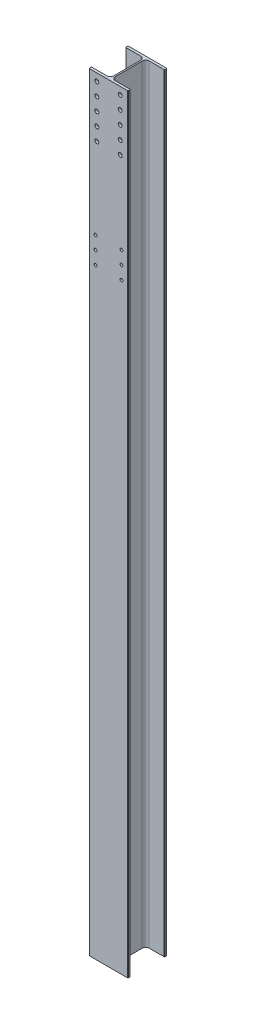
ISO-10303-21;
HEADER;
FILE_DESCRIPTION(('STEP AP214'),'2;1');
FILE_NAME('part.step','',(''),(''),'','','');
FILE_SCHEMA(('AUTOMOTIVE_DESIGN { 1 0 10303 214 1 1 1 1 }'));
ENDSEC;
DATA;
#1=APPLICATION_CONTEXT('core data for automotive mechanical design processes');
#2=APPLICATION_PROTOCOL_DEFINITION('international standard','automotive_design',2000,#1);
#3=PRODUCT_CONTEXT('',#1,'mechanical');
#4=PRODUCT('Part','Part','',(#3));
#5=PRODUCT_RELATED_PRODUCT_CATEGORY('part','',(#4));
#6=PRODUCT_DEFINITION_FORMATION('','',#4);
#7=PRODUCT_DEFINITION_CONTEXT('part definition',#1,'design');
#8=PRODUCT_DEFINITION('design','',#6,#7);
#9=PRODUCT_DEFINITION_SHAPE('','',#8);
#10=(LENGTH_UNIT() NAMED_UNIT(*) SI_UNIT(.MILLI.,.METRE.));
#11=(NAMED_UNIT(*) PLANE_ANGLE_UNIT() SI_UNIT($,.RADIAN.));
#12=(NAMED_UNIT(*) SI_UNIT($,.STERADIAN.) SOLID_ANGLE_UNIT());
#13=UNCERTAINTY_MEASURE_WITH_UNIT(LENGTH_MEASURE(1.E-05),#10,'distance_accuracy_value','');
#14=(GEOMETRIC_REPRESENTATION_CONTEXT(3) GLOBAL_UNCERTAINTY_ASSIGNED_CONTEXT((#13)) GLOBAL_UNIT_ASSIGNED_CONTEXT((#10,
#11,#12)) REPRESENTATION_CONTEXT('',''));
#15=CARTESIAN_POINT('',(0.,0.,0.));
#16=DIRECTION('',(0.,0.,1.));
#17=DIRECTION('',(1.,0.,0.));
#18=AXIS2_PLACEMENT_3D('',#15,#16,#17);
#19=CARTESIAN_POINT('',(32.5,5914.,-104.));
#20=DIRECTION('',(0.,-1.,0.));
#21=DIRECTION('',(0.,0.,-1.));
#22=AXIS2_PLACEMENT_3D('',#19,#20,#21);
#23=CYLINDRICAL_SURFACE('',#22,27.);
#24=CARTESIAN_POINT('',(32.5,0.,-104.));
#25=DIRECTION('',(0.,-1.,0.));
#26=DIRECTION('',(0.,0.,-1.));
#27=AXIS2_PLACEMENT_3D('',#24,#25,#26);
#28=CIRCLE('',#27,27.);
#29=CARTESIAN_POINT('',(5.49999999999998,0.,-104.));
#30=VERTEX_POINT('',#29);
#31=CARTESIAN_POINT('',(32.5000000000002,0.,-131.));
#32=VERTEX_POINT('',#31);
#33=EDGE_CURVE('E306',#30,#32,#28,.T.);
#34=ORIENTED_EDGE('',*,*,#33,.T.);
#35=DIRECTION('',(0.,-1.,0.));
#36=VECTOR('',#35,1.);
#37=CARTESIAN_POINT('',(32.5000000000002,5914.,-131.));
#38=LINE('',#37,#36);
#39=CARTESIAN_POINT('',(32.5000000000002,5914.,-131.));
#40=VERTEX_POINT('',#39);
#41=EDGE_CURVE('E13',#40,#32,#38,.T.);
#42=ORIENTED_EDGE('',*,*,#41,.F.);
#43=CARTESIAN_POINT('',(32.5,5914.,-104.));
#44=DIRECTION('',(0.,-1.,0.));
#45=DIRECTION('',(0.,0.,-1.));
#46=AXIS2_PLACEMENT_3D('',#43,#44,#45);
#47=CIRCLE('',#46,27.);
#48=CARTESIAN_POINT('',(5.49999999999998,5914.,-104.));
#49=VERTEX_POINT('',#48);
#50=EDGE_CURVE('E353',#49,#40,#47,.T.);
#51=ORIENTED_EDGE('',*,*,#50,.F.);
#52=DIRECTION('',(0.,-1.,0.));
#53=VECTOR('',#52,1.);
#54=CARTESIAN_POINT('',(5.49999999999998,5914.,-104.));
#55=LINE('',#54,#53);
#56=EDGE_CURVE('E302',#49,#30,#55,.T.);
#57=ORIENTED_EDGE('',*,*,#56,.T.);
#58=EDGE_LOOP('',(#34,#42,#51,#57));
#59=FACE_BOUND('',#58,.T.);
#60=ADVANCED_FACE('F112',(#59),#23,.F.);
#61=CARTESIAN_POINT('',(147.,5914.,-131.));
#62=DIRECTION('',(0.,0.,-1.));
#63=DIRECTION('',(-1.,0.,0.));
#64=AXIS2_PLACEMENT_3D('',#61,#62,#63);
#65=PLANE('',#64);
#66=DIRECTION('',(1.,0.,0.));
#67=VECTOR('',#66,1.);
#68=CARTESIAN_POINT('',(147.,0.,-131.));
#69=LINE('',#68,#67);
#70=CARTESIAN_POINT('',(147.,0.,-131.));
#71=VERTEX_POINT('',#70);
#72=EDGE_CURVE('E309',#32,#71,#69,.T.);
#73=ORIENTED_EDGE('',*,*,#72,.T.);
#74=DIRECTION('',(0.,-1.,0.));
#75=VECTOR('',#74,1.);
#76=CARTESIAN_POINT('',(147.,5914.,-131.));
#77=LINE('',#76,#75);
#78=CARTESIAN_POINT('',(147.,5914.,-131.));
#79=VERTEX_POINT('',#78);
#80=EDGE_CURVE('E121',#79,#71,#77,.T.);
#81=ORIENTED_EDGE('',*,*,#80,.F.);
#82=DIRECTION('',(1.,0.,0.));
#83=VECTOR('',#82,1.);
#84=CARTESIAN_POINT('',(147.,5914.,-131.));
#85=LINE('',#84,#83);
#86=EDGE_CURVE('E221',#40,#79,#85,.T.);
#87=ORIENTED_EDGE('',*,*,#86,.F.);
#88=ORIENTED_EDGE('',*,*,#41,.T.);
#89=EDGE_LOOP('',(#73,#81,#87,#88));
#90=FACE_BOUND('',#89,.T.);
#91=ADVANCED_FACE('F531',(#90),#65,.F.);
#92=CARTESIAN_POINT('',(147.,5914.,-134.));
#93=DIRECTION('',(0.,-1.,0.));
#94=DIRECTION('',(0.,0.,-1.));
#95=AXIS2_PLACEMENT_3D('',#92,#93,#94);
#96=CYLINDRICAL_SURFACE('',#95,3.);
#97=CARTESIAN_POINT('',(147.,0.,-134.));
#98=DIRECTION('',(0.,1.,0.));
#99=DIRECTION('',(0.,0.,1.));
#100=AXIS2_PLACEMENT_3D('',#97,#98,#99);
#101=CIRCLE('',#100,3.);
#102=CARTESIAN_POINT('',(150.,0.,-134.));
#103=VERTEX_POINT('',#102);
#104=EDGE_CURVE('E312',#71,#103,#101,.T.);
#105=ORIENTED_EDGE('',*,*,#104,.T.);
#106=DIRECTION('',(0.,-1.,0.));
#107=VECTOR('',#106,1.);
#108=CARTESIAN_POINT('',(150.,5914.,-134.));
#109=LINE('',#108,#107);
#110=CARTESIAN_POINT('',(150.,5914.,-134.));
#111=VERTEX_POINT('',#110);
#112=EDGE_CURVE('E408',#111,#103,#109,.T.);
#113=ORIENTED_EDGE('',*,*,#112,.F.);
#114=CARTESIAN_POINT('',(147.,5914.,-134.));
#115=DIRECTION('',(0.,1.,0.));
#116=DIRECTION('',(0.,0.,1.));
#117=AXIS2_PLACEMENT_3D('',#114,#115,#116);
#118=CIRCLE('',#117,3.);
#119=EDGE_CURVE('E468',#79,#111,#118,.T.);
#120=ORIENTED_EDGE('',*,*,#119,.F.);
#121=ORIENTED_EDGE('',*,*,#80,.T.);
#122=EDGE_LOOP('',(#105,#113,#120,#121));
#123=FACE_BOUND('',#122,.T.);
#124=ADVANCED_FACE('F535',(#123),#96,.T.);
#125=CARTESIAN_POINT('',(150.,5914.,-134.));
#126=DIRECTION('',(-1.,0.,0.));
#127=DIRECTION('',(0.,0.,1.));
#128=AXIS2_PLACEMENT_3D('',#125,#126,#127);
#129=PLANE('',#128);
#130=DIRECTION('',(0.,0.,-1.));
#131=VECTOR('',#130,1.);
#132=CARTESIAN_POINT('',(150.,0.,-134.));
#133=LINE('',#132,#131);
#134=CARTESIAN_POINT('',(150.,0.,-147.));
#135=VERTEX_POINT('',#134);
#136=EDGE_CURVE('E314',#103,#135,#133,.T.);
#137=ORIENTED_EDGE('',*,*,#136,.T.);
#138=DIRECTION('',(0.,-1.,0.));
#139=VECTOR('',#138,1.);
#140=CARTESIAN_POINT('',(150.,5914.,-147.));
#141=LINE('',#140,#139);
#142=CARTESIAN_POINT('',(150.,5914.,-147.));
#143=VERTEX_POINT('',#142);
#144=EDGE_CURVE('E405',#143,#135,#141,.T.);
#145=ORIENTED_EDGE('',*,*,#144,.F.);
#146=DIRECTION('',(0.,0.,-1.));
#147=VECTOR('',#146,1.);
#148=CARTESIAN_POINT('',(150.,5914.,-134.));
#149=LINE('',#148,#147);
#150=EDGE_CURVE('E470',#111,#143,#149,.T.);
#151=ORIENTED_EDGE('',*,*,#150,.F.);
#152=ORIENTED_EDGE('',*,*,#112,.T.);
#153=EDGE_LOOP('',(#137,#145,#151,#152));
#154=FACE_BOUND('',#153,.T.);
#155=ADVANCED_FACE('F539',(#154),#129,.F.);
#156=CARTESIAN_POINT('',(147.,5914.,-147.));
#157=DIRECTION('',(0.,-1.,0.));
#158=DIRECTION('',(0.,0.,-1.));
#159=AXIS2_PLACEMENT_3D('',#156,#157,#158);
#160=CYLINDRICAL_SURFACE('',#159,3.);
#161=CARTESIAN_POINT('',(147.,0.,-147.));
#162=DIRECTION('',(0.,1.,0.));
#163=DIRECTION('',(0.,0.,1.));
#164=AXIS2_PLACEMENT_3D('',#161,#162,#163);
#165=CIRCLE('',#164,3.);
#166=CARTESIAN_POINT('',(147.,0.,-150.));
#167=VERTEX_POINT('',#166);
#168=EDGE_CURVE('E316',#135,#167,#165,.T.);
#169=ORIENTED_EDGE('',*,*,#168,.T.);
#170=DIRECTION('',(0.,-1.,0.));
#171=VECTOR('',#170,1.);
#172=CARTESIAN_POINT('',(147.,5914.,-150.));
#173=LINE('',#172,#171);
#174=CARTESIAN_POINT('',(147.,5914.,-150.));
#175=VERTEX_POINT('',#174);
#176=EDGE_CURVE('E402',#175,#167,#173,.T.);
#177=ORIENTED_EDGE('',*,*,#176,.F.);
#178=CARTESIAN_POINT('',(147.,5914.,-147.));
#179=DIRECTION('',(0.,1.,0.));
#180=DIRECTION('',(0.,0.,1.));
#181=AXIS2_PLACEMENT_3D('',#178,#179,#180);
#182=CIRCLE('',#181,3.);
#183=EDGE_CURVE('E472',#143,#175,#182,.T.);
#184=ORIENTED_EDGE('',*,*,#183,.F.);
#185=ORIENTED_EDGE('',*,*,#144,.T.);
#186=EDGE_LOOP('',(#169,#177,#184,#185));
#187=FACE_BOUND('',#186,.T.);
#188=ADVANCED_FACE('F545',(#187),#160,.T.);
#189=CARTESIAN_POINT('',(147.,5914.,-150.));
#190=DIRECTION('',(0.,0.,1.));
#191=DIRECTION('',(1.,0.,0.));
#192=AXIS2_PLACEMENT_3D('',#189,#190,#191);
#193=PLANE('',#192);
#194=DIRECTION('',(-1.,0.,0.));
#195=VECTOR('',#194,1.);
#196=CARTESIAN_POINT('',(147.,0.,-150.));
#197=LINE('',#196,#195);
#198=CARTESIAN_POINT('',(-147.,0.,-150.));
#199=VERTEX_POINT('',#198);
#200=EDGE_CURVE('E318',#167,#199,#197,.T.);
#201=ORIENTED_EDGE('',*,*,#200,.T.);
#202=DIRECTION('',(0.,-1.,0.));
#203=VECTOR('',#202,1.);
#204=CARTESIAN_POINT('',(-147.,5914.,-150.));
#205=LINE('',#204,#203);
#206=CARTESIAN_POINT('',(-147.,5914.,-150.));
#207=VERTEX_POINT('',#206);
#208=EDGE_CURVE('E399',#207,#199,#205,.T.);
#209=ORIENTED_EDGE('',*,*,#208,.F.);
#210=DIRECTION('',(-1.,0.,0.));
#211=VECTOR('',#210,1.);
#212=CARTESIAN_POINT('',(147.,5914.,-150.));
#213=LINE('',#212,#211);
#214=EDGE_CURVE('E474',#175,#207,#213,.T.);
#215=ORIENTED_EDGE('',*,*,#214,.F.);
#216=ORIENTED_EDGE('',*,*,#176,.T.);
#217=EDGE_LOOP('',(#201,#209,#215,#216));
#218=FACE_BOUND('',#217,.T.);
#219=ADVANCED_FACE('F549',(#218),#193,.F.);
#220=CARTESIAN_POINT('',(-147.,5914.,-147.));
#221=DIRECTION('',(0.,-1.,0.));
#222=DIRECTION('',(0.,0.,-1.));
#223=AXIS2_PLACEMENT_3D('',#220,#221,#222);
#224=CYLINDRICAL_SURFACE('',#223,3.);
#225=CARTESIAN_POINT('',(-147.,0.,-147.));
#226=DIRECTION('',(0.,1.,0.));
#227=DIRECTION('',(0.,0.,-1.));
#228=AXIS2_PLACEMENT_3D('',#225,#226,#227);
#229=CIRCLE('',#228,3.);
#230=CARTESIAN_POINT('',(-150.,0.,-147.));
#231=VERTEX_POINT('',#230);
#232=EDGE_CURVE('E320',#199,#231,#229,.T.);
#233=ORIENTED_EDGE('',*,*,#232,.T.);
#234=DIRECTION('',(0.,-1.,0.));
#235=VECTOR('',#234,1.);
#236=CARTESIAN_POINT('',(-150.,5914.,-147.));
#237=LINE('',#236,#235);
#238=CARTESIAN_POINT('',(-150.,5914.,-147.));
#239=VERTEX_POINT('',#238);
#240=EDGE_CURVE('E396',#239,#231,#237,.T.);
#241=ORIENTED_EDGE('',*,*,#240,.F.);
#242=CARTESIAN_POINT('',(-147.,5914.,-147.));
#243=DIRECTION('',(0.,1.,0.));
#244=DIRECTION('',(0.,0.,-1.));
#245=AXIS2_PLACEMENT_3D('',#242,#243,#244);
#246=CIRCLE('',#245,3.);
#247=EDGE_CURVE('E476',#207,#239,#246,.T.);
#248=ORIENTED_EDGE('',*,*,#247,.F.);
#249=ORIENTED_EDGE('',*,*,#208,.T.);
#250=EDGE_LOOP('',(#233,#241,#248,#249));
#251=FACE_BOUND('',#250,.T.);
#252=ADVANCED_FACE('F553',(#251),#224,.T.);
#253=CARTESIAN_POINT('',(-150.,5914.,-134.));
#254=DIRECTION('',(1.,0.,0.));
#255=DIRECTION('',(0.,0.,-1.));
#256=AXIS2_PLACEMENT_3D('',#253,#254,#255);
#257=PLANE('',#256);
#258=DIRECTION('',(0.,0.,1.));
#259=VECTOR('',#258,1.);
#260=CARTESIAN_POINT('',(-150.,0.,-134.));
#261=LINE('',#260,#259);
#262=CARTESIAN_POINT('',(-150.,0.,-134.));
#263=VERTEX_POINT('',#262);
#264=EDGE_CURVE('E322',#231,#263,#261,.T.);
#265=ORIENTED_EDGE('',*,*,#264,.T.);
#266=DIRECTION('',(0.,-1.,0.));
#267=VECTOR('',#266,1.);
#268=CARTESIAN_POINT('',(-150.,5914.,-134.));
#269=LINE('',#268,#267);
#270=CARTESIAN_POINT('',(-150.,5914.,-134.));
#271=VERTEX_POINT('',#270);
#272=EDGE_CURVE('E393',#271,#263,#269,.T.);
#273=ORIENTED_EDGE('',*,*,#272,.F.);
#274=DIRECTION('',(0.,0.,1.));
#275=VECTOR('',#274,1.);
#276=CARTESIAN_POINT('',(-150.,5914.,-134.));
#277=LINE('',#276,#275);
#278=EDGE_CURVE('E478',#239,#271,#277,.T.);
#279=ORIENTED_EDGE('',*,*,#278,.F.);
#280=ORIENTED_EDGE('',*,*,#240,.T.);
#281=EDGE_LOOP('',(#265,#273,#279,#280));
#282=FACE_BOUND('',#281,.T.);
#283=ADVANCED_FACE('F557',(#282),#257,.F.);
#284=CARTESIAN_POINT('',(-147.,5914.,-134.));
#285=DIRECTION('',(0.,-1.,0.));
#286=DIRECTION('',(0.,0.,-1.));
#287=AXIS2_PLACEMENT_3D('',#284,#285,#286);
#288=CYLINDRICAL_SURFACE('',#287,3.);
#289=CARTESIAN_POINT('',(-147.,0.,-134.));
#290=DIRECTION('',(0.,1.,0.));
#291=DIRECTION('',(0.,0.,-1.));
#292=AXIS2_PLACEMENT_3D('',#289,#290,#291);
#293=CIRCLE('',#292,3.);
#294=CARTESIAN_POINT('',(-147.,0.,-131.));
#295=VERTEX_POINT('',#294);
#296=EDGE_CURVE('E324',#263,#295,#293,.T.);
#297=ORIENTED_EDGE('',*,*,#296,.T.);
#298=DIRECTION('',(0.,-1.,0.));
#299=VECTOR('',#298,1.);
#300=CARTESIAN_POINT('',(-147.,5914.,-131.));
#301=LINE('',#300,#299);
#302=CARTESIAN_POINT('',(-147.,5914.,-131.));
#303=VERTEX_POINT('',#302);
#304=EDGE_CURVE('E390',#303,#295,#301,.T.);
#305=ORIENTED_EDGE('',*,*,#304,.F.);
#306=CARTESIAN_POINT('',(-147.,5914.,-134.));
#307=DIRECTION('',(0.,1.,0.));
#308=DIRECTION('',(0.,0.,-1.));
#309=AXIS2_PLACEMENT_3D('',#306,#307,#308);
#310=CIRCLE('',#309,3.);
#311=EDGE_CURVE('E480',#271,#303,#310,.T.);
#312=ORIENTED_EDGE('',*,*,#311,.F.);
#313=ORIENTED_EDGE('',*,*,#272,.T.);
#314=EDGE_LOOP('',(#297,#305,#312,#313));
#315=FACE_BOUND('',#314,.T.);
#316=ADVANCED_FACE('F561',(#315),#288,.T.);
#317=CARTESIAN_POINT('',(-32.5000000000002,5914.,-131.));
#318=DIRECTION('',(0.,0.,-1.));
#319=DIRECTION('',(-1.,0.,0.));
#320=AXIS2_PLACEMENT_3D('',#317,#318,#319);
#321=PLANE('',#320);
#322=DIRECTION('',(1.,0.,0.));
#323=VECTOR('',#322,1.);
#324=CARTESIAN_POINT('',(-32.5000000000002,0.,-131.));
#325=LINE('',#324,#323);
#326=CARTESIAN_POINT('',(-32.5000000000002,0.,-131.));
#327=VERTEX_POINT('',#326);
#328=EDGE_CURVE('E326',#295,#327,#325,.T.);
#329=ORIENTED_EDGE('',*,*,#328,.T.);
#330=DIRECTION('',(0.,-1.,0.));
#331=VECTOR('',#330,1.);
#332=CARTESIAN_POINT('',(-32.5000000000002,5914.,-131.));
#333=LINE('',#332,#331);
#334=CARTESIAN_POINT('',(-32.5000000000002,5914.,-131.));
#335=VERTEX_POINT('',#334);
#336=EDGE_CURVE('E387',#335,#327,#333,.T.);
#337=ORIENTED_EDGE('',*,*,#336,.F.);
#338=DIRECTION('',(1.,0.,0.));
#339=VECTOR('',#338,1.);
#340=CARTESIAN_POINT('',(-32.5000000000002,5914.,-131.));
#341=LINE('',#340,#339);
#342=EDGE_CURVE('E482',#303,#335,#341,.T.);
#343=ORIENTED_EDGE('',*,*,#342,.F.);
#344=ORIENTED_EDGE('',*,*,#304,.T.);
#345=EDGE_LOOP('',(#329,#337,#343,#344));
#346=FACE_BOUND('',#345,.T.);
#347=ADVANCED_FACE('F565',(#346),#321,.F.);
#348=CARTESIAN_POINT('',(-32.5,5914.,-104.));
#349=DIRECTION('',(0.,-1.,0.));
#350=DIRECTION('',(0.,0.,-1.));
#351=AXIS2_PLACEMENT_3D('',#348,#349,#350);
#352=CYLINDRICAL_SURFACE('',#351,27.);
#353=CARTESIAN_POINT('',(-32.5,0.,-104.));
#354=DIRECTION('',(0.,-1.,0.));
#355=DIRECTION('',(0.,0.,1.));
#356=AXIS2_PLACEMENT_3D('',#353,#354,#355);
#357=CIRCLE('',#356,27.);
#358=CARTESIAN_POINT('',(-5.50000000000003,0.,-104.));
#359=VERTEX_POINT('',#358);
#360=EDGE_CURVE('E328',#327,#359,#357,.T.);
#361=ORIENTED_EDGE('',*,*,#360,.T.);
#362=DIRECTION('',(0.,-1.,0.));
#363=VECTOR('',#362,1.);
#364=CARTESIAN_POINT('',(-5.50000000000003,5914.,-104.));
#365=LINE('',#364,#363);
#366=CARTESIAN_POINT('',(-5.50000000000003,5914.,-104.));
#367=VERTEX_POINT('',#366);
#368=EDGE_CURVE('E384',#367,#359,#365,.T.);
#369=ORIENTED_EDGE('',*,*,#368,.F.);
#370=CARTESIAN_POINT('',(-32.5,5914.,-104.));
#371=DIRECTION('',(0.,-1.,0.));
#372=DIRECTION('',(0.,0.,1.));
#373=AXIS2_PLACEMENT_3D('',#370,#371,#372);
#374=CIRCLE('',#373,27.);
#375=EDGE_CURVE('E484',#335,#367,#374,.T.);
#376=ORIENTED_EDGE('',*,*,#375,.F.);
#377=ORIENTED_EDGE('',*,*,#336,.T.);
#378=EDGE_LOOP('',(#361,#369,#376,#377));
#379=FACE_BOUND('',#378,.T.);
#380=ADVANCED_FACE('F569',(#379),#352,.F.);
#381=CARTESIAN_POINT('',(-5.50000000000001,5914.,104.));
#382=DIRECTION('',(1.,0.,0.));
#383=DIRECTION('',(0.,0.,-1.));
#384=AXIS2_PLACEMENT_3D('',#381,#382,#383);
#385=PLANE('',#384);
#386=DIRECTION('',(0.,0.,1.));
#387=VECTOR('',#386,1.);
#388=CARTESIAN_POINT('',(-5.50000000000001,0.,104.));
#389=LINE('',#388,#387);
#390=CARTESIAN_POINT('',(-5.50000000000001,0.,104.));
#391=VERTEX_POINT('',#390);
#392=EDGE_CURVE('E330',#359,#391,#389,.T.);
#393=ORIENTED_EDGE('',*,*,#392,.T.);
#394=DIRECTION('',(0.,-1.,0.));
#395=VECTOR('',#394,1.);
#396=CARTESIAN_POINT('',(-5.50000000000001,5914.,104.));
#397=LINE('',#396,#395);
#398=CARTESIAN_POINT('',(-5.50000000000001,5914.,104.));
#399=VERTEX_POINT('',#398);
#400=EDGE_CURVE('E381',#399,#391,#397,.T.);
#401=ORIENTED_EDGE('',*,*,#400,.F.);
#402=DIRECTION('',(0.,0.,1.));
#403=VECTOR('',#402,1.);
#404=CARTESIAN_POINT('',(-5.50000000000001,5914.,104.));
#405=LINE('',#404,#403);
#406=EDGE_CURVE('E486',#367,#399,#405,.T.);
#407=ORIENTED_EDGE('',*,*,#406,.F.);
#408=ORIENTED_EDGE('',*,*,#368,.T.);
#409=EDGE_LOOP('',(#393,#401,#407,#408));
#410=FACE_BOUND('',#409,.T.);
#411=ADVANCED_FACE('F573',(#410),#385,.F.);
#412=CARTESIAN_POINT('',(-32.5,5914.,104.));
#413=DIRECTION('',(0.,-1.,0.));
#414=DIRECTION('',(0.,0.,-1.));
#415=AXIS2_PLACEMENT_3D('',#412,#413,#414);
#416=CYLINDRICAL_SURFACE('',#415,27.);
#417=CARTESIAN_POINT('',(-32.5,0.,104.));
#418=DIRECTION('',(0.,-1.,0.));
#419=DIRECTION('',(0.,0.,-1.));
#420=AXIS2_PLACEMENT_3D('',#417,#418,#419);
#421=CIRCLE('',#420,27.);
#422=CARTESIAN_POINT('',(-32.5000000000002,0.,131.));
#423=VERTEX_POINT('',#422);
#424=EDGE_CURVE('E332',#391,#423,#421,.T.);
#425=ORIENTED_EDGE('',*,*,#424,.T.);
#426=DIRECTION('',(0.,-1.,0.));
#427=VECTOR('',#426,1.);
#428=CARTESIAN_POINT('',(-32.5000000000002,5914.,131.));
#429=LINE('',#428,#427);
#430=CARTESIAN_POINT('',(-32.5000000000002,5914.,131.));
#431=VERTEX_POINT('',#430);
#432=EDGE_CURVE('E378',#431,#423,#429,.T.);
#433=ORIENTED_EDGE('',*,*,#432,.F.);
#434=CARTESIAN_POINT('',(-32.5,5914.,104.));
#435=DIRECTION('',(0.,-1.,0.));
#436=DIRECTION('',(0.,0.,-1.));
#437=AXIS2_PLACEMENT_3D('',#434,#435,#436);
#438=CIRCLE('',#437,27.);
#439=EDGE_CURVE('E488',#399,#431,#438,.T.);
#440=ORIENTED_EDGE('',*,*,#439,.F.);
#441=ORIENTED_EDGE('',*,*,#400,.T.);
#442=EDGE_LOOP('',(#425,#433,#440,#441));
#443=FACE_BOUND('',#442,.T.);
#444=ADVANCED_FACE('F577',(#443),#416,.F.);
#445=CARTESIAN_POINT('',(-32.5000000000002,5914.,131.));
#446=DIRECTION('',(0.,0.,1.));
#447=DIRECTION('',(1.,0.,0.));
#448=AXIS2_PLACEMENT_3D('',#445,#446,#447);
#449=PLANE('',#448);
#450=CARTESIAN_POINT('',(-89.999999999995,5657.,131.));
#451=DIRECTION('',(0.,0.,1.));
#452=DIRECTION('',(1.,0.,0.));
#453=AXIS2_PLACEMENT_3D('',#450,#451,#452);
#454=CIRCLE('',#453,15.25);
#455=CARTESIAN_POINT('',(-74.749999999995,5657.,131.));
#456=VERTEX_POINT('',#455);
#457=EDGE_CURVE('E310',#456,#456,#454,.T.);
#458=ORIENTED_EDGE('',*,*,#457,.T.);
#459=EDGE_LOOP('',(#458));
#460=FACE_BOUND('',#459,.T.);
#461=CARTESIAN_POINT('',(-89.9999999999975,5757.,131.));
#462=DIRECTION('',(0.,0.,1.));
#463=DIRECTION('',(1.,0.,0.));
#464=AXIS2_PLACEMENT_3D('',#461,#462,#463);
#465=CIRCLE('',#464,15.25);
#466=CARTESIAN_POINT('',(-74.7499999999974,5757.,131.));
#467=VERTEX_POINT('',#466);
#468=EDGE_CURVE('E461',#467,#467,#465,.T.);
#469=ORIENTED_EDGE('',*,*,#468,.T.);
#470=EDGE_LOOP('',(#469));
#471=FACE_BOUND('',#470,.T.);
#472=CARTESIAN_POINT('',(-99.9999999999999,4828.5,131.));
#473=DIRECTION('',(0.,0.,1.));
#474=DIRECTION('',(1.,0.,0.));
#475=AXIS2_PLACEMENT_3D('',#472,#473,#474);
#476=CIRCLE('',#475,11.25);
#477=CARTESIAN_POINT('',(-88.7499999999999,4828.5,131.));
#478=VERTEX_POINT('',#477);
#479=EDGE_CURVE('E458',#478,#478,#476,.T.);
#480=ORIENTED_EDGE('',*,*,#479,.T.);
#481=EDGE_LOOP('',(#480));
#482=FACE_BOUND('',#481,.T.);
#483=CARTESIAN_POINT('',(-99.9999999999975,4728.,131.));
#484=DIRECTION('',(0.,0.,1.));
#485=DIRECTION('',(1.,0.,0.));
#486=AXIS2_PLACEMENT_3D('',#483,#484,#485);
#487=CIRCLE('',#486,11.25);
#488=CARTESIAN_POINT('',(-88.7499999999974,4728.,131.));
#489=VERTEX_POINT('',#488);
#490=EDGE_CURVE('E455',#489,#489,#487,.T.);
#491=ORIENTED_EDGE('',*,*,#490,.T.);
#492=EDGE_LOOP('',(#491));
#493=FACE_BOUND('',#492,.T.);
#494=CARTESIAN_POINT('',(-99.999999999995,4627.5,131.));
#495=DIRECTION('',(0.,0.,1.));
#496=DIRECTION('',(1.,0.,0.));
#497=AXIS2_PLACEMENT_3D('',#494,#495,#496);
#498=CIRCLE('',#497,11.25);
#499=CARTESIAN_POINT('',(-88.749999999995,4627.5,131.));
#500=VERTEX_POINT('',#499);
#501=EDGE_CURVE('E452',#500,#500,#498,.T.);
#502=ORIENTED_EDGE('',*,*,#501,.T.);
#503=EDGE_LOOP('',(#502));
#504=FACE_BOUND('',#503,.T.);
#505=CARTESIAN_POINT('',(-89.9999999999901,5457.,131.));
#506=DIRECTION('',(0.,0.,1.));
#507=DIRECTION('',(1.,0.,0.));
#508=AXIS2_PLACEMENT_3D('',#505,#506,#507);
#509=CIRCLE('',#508,15.25);
#510=CARTESIAN_POINT('',(-74.74999999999,5457.,131.));
#511=VERTEX_POINT('',#510);
#512=EDGE_CURVE('E445',#511,#511,#509,.T.);
#513=ORIENTED_EDGE('',*,*,#512,.T.);
#514=EDGE_LOOP('',(#513));
#515=FACE_BOUND('',#514,.T.);
#516=CARTESIAN_POINT('',(-89.9999999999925,5557.,131.));
#517=DIRECTION('',(0.,0.,1.));
#518=DIRECTION('',(1.,0.,0.));
#519=AXIS2_PLACEMENT_3D('',#516,#517,#518);
#520=CIRCLE('',#519,15.25);
#521=CARTESIAN_POINT('',(-74.7499999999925,5557.,131.));
#522=VERTEX_POINT('',#521);
#523=EDGE_CURVE('E440',#522,#522,#520,.T.);
#524=ORIENTED_EDGE('',*,*,#523,.T.);
#525=EDGE_LOOP('',(#524));
#526=FACE_BOUND('',#525,.T.);
#527=CARTESIAN_POINT('',(-89.9999999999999,5857.,131.));
#528=DIRECTION('',(0.,0.,1.));
#529=DIRECTION('',(1.,0.,0.));
#530=AXIS2_PLACEMENT_3D('',#527,#528,#529);
#531=CIRCLE('',#530,15.25);
#532=CARTESIAN_POINT('',(-74.7499999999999,5857.,131.));
#533=VERTEX_POINT('',#532);
#534=EDGE_CURVE('E436',#533,#533,#531,.T.);
#535=ORIENTED_EDGE('',*,*,#534,.T.);
#536=EDGE_LOOP('',(#535));
#537=FACE_BOUND('',#536,.T.);
#538=DIRECTION('',(-1.,0.,0.));
#539=VECTOR('',#538,1.);
#540=CARTESIAN_POINT('',(-32.5000000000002,0.,131.));
#541=LINE('',#540,#539);
#542=CARTESIAN_POINT('',(-147.,0.,131.));
#543=VERTEX_POINT('',#542);
#544=EDGE_CURVE('E334',#423,#543,#541,.T.);
#545=ORIENTED_EDGE('',*,*,#544,.T.);
#546=DIRECTION('',(0.,-1.,0.));
#547=VECTOR('',#546,1.);
#548=CARTESIAN_POINT('',(-147.,5914.,131.));
#549=LINE('',#548,#547);
#550=CARTESIAN_POINT('',(-147.,5914.,131.));
#551=VERTEX_POINT('',#550);
#552=EDGE_CURVE('E375',#551,#543,#549,.T.);
#553=ORIENTED_EDGE('',*,*,#552,.F.);
#554=DIRECTION('',(-1.,0.,0.));
#555=VECTOR('',#554,1.);
#556=CARTESIAN_POINT('',(-32.5000000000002,5914.,131.));
#557=LINE('',#556,#555);
#558=EDGE_CURVE('E490',#431,#551,#557,.T.);
#559=ORIENTED_EDGE('',*,*,#558,.F.);
#560=ORIENTED_EDGE('',*,*,#432,.T.);
#561=EDGE_LOOP('',(#545,#553,#559,#560));
#562=FACE_BOUND('',#561,.T.);
#563=ADVANCED_FACE('F581',(#460,#471,#482,#493,#504,#515,#526,#537,#562),#449,.F.);
#564=CARTESIAN_POINT('',(-147.,5914.,134.));
#565=DIRECTION('',(0.,-1.,0.));
#566=DIRECTION('',(0.,0.,-1.));
#567=AXIS2_PLACEMENT_3D('',#564,#565,#566);
#568=CYLINDRICAL_SURFACE('',#567,3.);
#569=CARTESIAN_POINT('',(-147.,0.,134.));
#570=DIRECTION('',(0.,1.,0.));
#571=DIRECTION('',(0.,0.,1.));
#572=AXIS2_PLACEMENT_3D('',#569,#570,#571);
#573=CIRCLE('',#572,3.);
#574=CARTESIAN_POINT('',(-150.,0.,134.));
#575=VERTEX_POINT('',#574);
#576=EDGE_CURVE('E336',#543,#575,#573,.T.);
#577=ORIENTED_EDGE('',*,*,#576,.T.);
#578=DIRECTION('',(0.,-1.,0.));
#579=VECTOR('',#578,1.);
#580=CARTESIAN_POINT('',(-150.,5914.,134.));
#581=LINE('',#580,#579);
#582=CARTESIAN_POINT('',(-150.,5914.,134.));
#583=VERTEX_POINT('',#582);
#584=EDGE_CURVE('E372',#583,#575,#581,.T.);
#585=ORIENTED_EDGE('',*,*,#584,.F.);
#586=CARTESIAN_POINT('',(-147.,5914.,134.));
#587=DIRECTION('',(0.,1.,0.));
#588=DIRECTION('',(0.,0.,1.));
#589=AXIS2_PLACEMENT_3D('',#586,#587,#588);
#590=CIRCLE('',#589,3.);
#591=EDGE_CURVE('E492',#551,#583,#590,.T.);
#592=ORIENTED_EDGE('',*,*,#591,.F.);
#593=ORIENTED_EDGE('',*,*,#552,.T.);
#594=EDGE_LOOP('',(#577,#585,#592,#593));
#595=FACE_BOUND('',#594,.T.);
#596=ADVANCED_FACE('F585',(#595),#568,.T.);
#597=CARTESIAN_POINT('',(-150.,5914.,147.));
#598=DIRECTION('',(1.,0.,0.));
#599=DIRECTION('',(0.,0.,-1.));
#600=AXIS2_PLACEMENT_3D('',#597,#598,#599);
#601=PLANE('',#600);
#602=DIRECTION('',(0.,0.,1.));
#603=VECTOR('',#602,1.);
#604=CARTESIAN_POINT('',(-150.,0.,147.));
#605=LINE('',#604,#603);
#606=CARTESIAN_POINT('',(-150.,0.,147.));
#607=VERTEX_POINT('',#606);
#608=EDGE_CURVE('E338',#575,#607,#605,.T.);
#609=ORIENTED_EDGE('',*,*,#608,.T.);
#610=DIRECTION('',(0.,-1.,0.));
#611=VECTOR('',#610,1.);
#612=CARTESIAN_POINT('',(-150.,5914.,147.));
#613=LINE('',#612,#611);
#614=CARTESIAN_POINT('',(-150.,5914.,147.));
#615=VERTEX_POINT('',#614);
#616=EDGE_CURVE('E369',#615,#607,#613,.T.);
#617=ORIENTED_EDGE('',*,*,#616,.F.);
#618=DIRECTION('',(0.,0.,1.));
#619=VECTOR('',#618,1.);
#620=CARTESIAN_POINT('',(-150.,5914.,147.));
#621=LINE('',#620,#619);
#622=EDGE_CURVE('E494',#583,#615,#621,.T.);
#623=ORIENTED_EDGE('',*,*,#622,.F.);
#624=ORIENTED_EDGE('',*,*,#584,.T.);
#625=EDGE_LOOP('',(#609,#617,#623,#624));
#626=FACE_BOUND('',#625,.T.);
#627=ADVANCED_FACE('F589',(#626),#601,.F.);
#628=CARTESIAN_POINT('',(-147.,5914.,147.));
#629=DIRECTION('',(0.,-1.,0.));
#630=DIRECTION('',(0.,0.,-1.));
#631=AXIS2_PLACEMENT_3D('',#628,#629,#630);
#632=CYLINDRICAL_SURFACE('',#631,3.);
#633=CARTESIAN_POINT('',(-147.,0.,147.));
#634=DIRECTION('',(0.,1.,0.));
#635=DIRECTION('',(0.,0.,1.));
#636=AXIS2_PLACEMENT_3D('',#633,#634,#635);
#637=CIRCLE('',#636,3.);
#638=CARTESIAN_POINT('',(-147.,0.,150.));
#639=VERTEX_POINT('',#638);
#640=EDGE_CURVE('E340',#607,#639,#637,.T.);
#641=ORIENTED_EDGE('',*,*,#640,.T.);
#642=DIRECTION('',(0.,-1.,0.));
#643=VECTOR('',#642,1.);
#644=CARTESIAN_POINT('',(-147.,5914.,150.));
#645=LINE('',#644,#643);
#646=CARTESIAN_POINT('',(-147.,5914.,150.));
#647=VERTEX_POINT('',#646);
#648=EDGE_CURVE('E366',#647,#639,#645,.T.);
#649=ORIENTED_EDGE('',*,*,#648,.F.);
#650=CARTESIAN_POINT('',(-147.,5914.,147.));
#651=DIRECTION('',(0.,1.,0.));
#652=DIRECTION('',(0.,0.,1.));
#653=AXIS2_PLACEMENT_3D('',#650,#651,#652);
#654=CIRCLE('',#653,3.);
#655=EDGE_CURVE('E496',#615,#647,#654,.T.);
#656=ORIENTED_EDGE('',*,*,#655,.F.);
#657=ORIENTED_EDGE('',*,*,#616,.T.);
#658=EDGE_LOOP('',(#641,#649,#656,#657));
#659=FACE_BOUND('',#658,.T.);
#660=ADVANCED_FACE('F593',(#659),#632,.T.);
#661=CARTESIAN_POINT('',(147.,5914.,150.));
#662=DIRECTION('',(0.,0.,-1.));
#663=DIRECTION('',(-1.,0.,0.));
#664=AXIS2_PLACEMENT_3D('',#661,#662,#663);
#665=PLANE('',#664);
#666=CARTESIAN_POINT('',(-89.999999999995,5657.,150.));
#667=DIRECTION('',(0.,0.,1.));
#668=DIRECTION('',(1.,0.,0.));
#669=AXIS2_PLACEMENT_3D('',#666,#667,#668);
#670=CIRCLE('',#669,15.25);
#671=CARTESIAN_POINT('',(-74.749999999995,5657.,150.));
#672=VERTEX_POINT('',#671);
#673=EDGE_CURVE('E702',#672,#672,#670,.T.);
#674=ORIENTED_EDGE('',*,*,#673,.F.);
#675=EDGE_LOOP('',(#674));
#676=FACE_BOUND('',#675,.T.);
#677=CARTESIAN_POINT('',(-89.9999999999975,5757.,150.));
#678=DIRECTION('',(0.,0.,1.));
#679=DIRECTION('',(1.,0.,0.));
#680=AXIS2_PLACEMENT_3D('',#677,#678,#679);
#681=CIRCLE('',#680,15.25);
#682=CARTESIAN_POINT('',(-74.7499999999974,5757.,150.));
#683=VERTEX_POINT('',#682);
#684=EDGE_CURVE('E705',#683,#683,#681,.T.);
#685=ORIENTED_EDGE('',*,*,#684,.F.);
#686=EDGE_LOOP('',(#685));
#687=FACE_BOUND('',#686,.T.);
#688=CARTESIAN_POINT('',(90.0000000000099,5457.,150.));
#689=DIRECTION('',(0.,0.,1.));
#690=DIRECTION('',(1.,0.,0.));
#691=AXIS2_PLACEMENT_3D('',#688,#689,#690);
#692=CIRCLE('',#691,15.25);
#693=CARTESIAN_POINT('',(105.25000000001,5457.,150.));
#694=VERTEX_POINT('',#693);
#695=EDGE_CURVE('E709',#694,#694,#692,.T.);
#696=ORIENTED_EDGE('',*,*,#695,.F.);
#697=EDGE_LOOP('',(#696));
#698=FACE_BOUND('',#697,.T.);
#699=CARTESIAN_POINT('',(90.0000000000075,5557.,150.));
#700=DIRECTION('',(0.,0.,1.));
#701=DIRECTION('',(1.,0.,0.));
#702=AXIS2_PLACEMENT_3D('',#699,#700,#701);
#703=CIRCLE('',#702,15.25);
#704=CARTESIAN_POINT('',(105.250000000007,5557.,150.));
#705=VERTEX_POINT('',#704);
#706=EDGE_CURVE('E699',#705,#705,#703,.T.);
#707=ORIENTED_EDGE('',*,*,#706,.F.);
#708=EDGE_LOOP('',(#707));
#709=FACE_BOUND('',#708,.T.);
#710=CARTESIAN_POINT('',(-99.9999999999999,4828.5,150.));
#711=DIRECTION('',(0.,0.,1.));
#712=DIRECTION('',(1.,0.,0.));
#713=AXIS2_PLACEMENT_3D('',#710,#711,#712);
#714=CIRCLE('',#713,11.25);
#715=CARTESIAN_POINT('',(-88.7499999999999,4828.5,150.));
#716=VERTEX_POINT('',#715);
#717=EDGE_CURVE('E688',#716,#716,#714,.T.);
#718=ORIENTED_EDGE('',*,*,#717,.F.);
#719=EDGE_LOOP('',(#718));
#720=FACE_BOUND('',#719,.T.);
#721=CARTESIAN_POINT('',(90.0000000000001,5857.,150.));
#722=DIRECTION('',(0.,0.,1.));
#723=DIRECTION('',(1.,0.,0.));
#724=AXIS2_PLACEMENT_3D('',#721,#722,#723);
#725=CIRCLE('',#724,15.25);
#726=CARTESIAN_POINT('',(105.25,5857.,150.));
#727=VERTEX_POINT('',#726);
#728=EDGE_CURVE('E690',#727,#727,#725,.T.);
#729=ORIENTED_EDGE('',*,*,#728,.F.);
#730=EDGE_LOOP('',(#729));
#731=FACE_BOUND('',#730,.T.);
#732=CARTESIAN_POINT('',(90.0000000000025,5757.,150.));
#733=DIRECTION('',(0.,0.,1.));
#734=DIRECTION('',(1.,0.,0.));
#735=AXIS2_PLACEMENT_3D('',#732,#733,#734);
#736=CIRCLE('',#735,15.25);
#737=CARTESIAN_POINT('',(105.250000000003,5757.,150.));
#738=VERTEX_POINT('',#737);
#739=EDGE_CURVE('E694',#738,#738,#736,.T.);
#740=ORIENTED_EDGE('',*,*,#739,.F.);
#741=EDGE_LOOP('',(#740));
#742=FACE_BOUND('',#741,.T.);
#743=CARTESIAN_POINT('',(90.000000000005,5657.,150.));
#744=DIRECTION('',(0.,0.,1.));
#745=DIRECTION('',(1.,0.,0.));
#746=AXIS2_PLACEMENT_3D('',#743,#744,#745);
#747=CIRCLE('',#746,15.25);
#748=CARTESIAN_POINT('',(105.250000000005,5657.,150.));
#749=VERTEX_POINT('',#748);
#750=EDGE_CURVE('E696',#749,#749,#747,.T.);
#751=ORIENTED_EDGE('',*,*,#750,.F.);
#752=EDGE_LOOP('',(#751));
#753=FACE_BOUND('',#752,.T.);
#754=CARTESIAN_POINT('',(100.000000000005,4627.5,150.));
#755=DIRECTION('',(0.,0.,1.));
#756=DIRECTION('',(1.,0.,0.));
#757=AXIS2_PLACEMENT_3D('',#754,#755,#756);
#758=CIRCLE('',#757,11.25);
#759=CARTESIAN_POINT('',(111.250000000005,4627.5,150.));
#760=VERTEX_POINT('',#759);
#761=EDGE_CURVE('E718',#760,#760,#758,.T.);
#762=ORIENTED_EDGE('',*,*,#761,.F.);
#763=EDGE_LOOP('',(#762));
#764=FACE_BOUND('',#763,.T.);
#765=CARTESIAN_POINT('',(-99.9999999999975,4728.,150.));
#766=DIRECTION('',(0.,0.,1.));
#767=DIRECTION('',(1.,0.,0.));
#768=AXIS2_PLACEMENT_3D('',#765,#766,#767);
#769=CIRCLE('',#768,11.25);
#770=CARTESIAN_POINT('',(-88.7499999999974,4728.,150.));
#771=VERTEX_POINT('',#770);
#772=EDGE_CURVE('E725',#771,#771,#769,.T.);
#773=ORIENTED_EDGE('',*,*,#772,.F.);
#774=EDGE_LOOP('',(#773));
#775=FACE_BOUND('',#774,.T.);
#776=CARTESIAN_POINT('',(-99.999999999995,4627.5,150.));
#777=DIRECTION('',(0.,0.,1.));
#778=DIRECTION('',(1.,0.,0.));
#779=AXIS2_PLACEMENT_3D('',#776,#777,#778);
#780=CIRCLE('',#779,11.25);
#781=CARTESIAN_POINT('',(-88.749999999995,4627.5,150.));
#782=VERTEX_POINT('',#781);
#783=EDGE_CURVE('E728',#782,#782,#780,.T.);
#784=ORIENTED_EDGE('',*,*,#783,.F.);
#785=EDGE_LOOP('',(#784));
#786=FACE_BOUND('',#785,.T.);
#787=CARTESIAN_POINT('',(100.000000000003,4728.,150.));
#788=DIRECTION('',(0.,0.,1.));
#789=DIRECTION('',(1.,0.,0.));
#790=AXIS2_PLACEMENT_3D('',#787,#788,#789);
#791=CIRCLE('',#790,11.25);
#792=CARTESIAN_POINT('',(111.250000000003,4728.,150.));
#793=VERTEX_POINT('',#792);
#794=EDGE_CURVE('E714',#793,#793,#791,.T.);
#795=ORIENTED_EDGE('',*,*,#794,.F.);
#796=EDGE_LOOP('',(#795));
#797=FACE_BOUND('',#796,.T.);
#798=CARTESIAN_POINT('',(100.,4828.5,150.));
#799=DIRECTION('',(0.,0.,1.));
#800=DIRECTION('',(1.,0.,0.));
#801=AXIS2_PLACEMENT_3D('',#798,#799,#800);
#802=CIRCLE('',#801,11.25);
#803=CARTESIAN_POINT('',(111.25,4828.5,150.));
#804=VERTEX_POINT('',#803);
#805=EDGE_CURVE('E717',#804,#804,#802,.T.);
#806=ORIENTED_EDGE('',*,*,#805,.F.);
#807=EDGE_LOOP('',(#806));
#808=FACE_BOUND('',#807,.T.);
#809=CARTESIAN_POINT('',(-89.9999999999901,5457.,150.));
#810=DIRECTION('',(0.,0.,1.));
#811=DIRECTION('',(1.,0.,0.));
#812=AXIS2_PLACEMENT_3D('',#809,#810,#811);
#813=CIRCLE('',#812,15.25);
#814=CARTESIAN_POINT('',(-74.74999999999,5457.,150.));
#815=VERTEX_POINT('',#814);
#816=EDGE_CURVE('E720',#815,#815,#813,.T.);
#817=ORIENTED_EDGE('',*,*,#816,.F.);
#818=EDGE_LOOP('',(#817));
#819=FACE_BOUND('',#818,.T.);
#820=CARTESIAN_POINT('',(-89.9999999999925,5557.,150.));
#821=DIRECTION('',(0.,0.,1.));
#822=DIRECTION('',(1.,0.,0.));
#823=AXIS2_PLACEMENT_3D('',#820,#821,#822);
#824=CIRCLE('',#823,15.25);
#825=CARTESIAN_POINT('',(-74.7499999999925,5557.,150.));
#826=VERTEX_POINT('',#825);
#827=EDGE_CURVE('E706',#826,#826,#824,.T.);
#828=ORIENTED_EDGE('',*,*,#827,.F.);
#829=EDGE_LOOP('',(#828));
#830=FACE_BOUND('',#829,.T.);
#831=CARTESIAN_POINT('',(-89.9999999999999,5857.,150.));
#832=DIRECTION('',(0.,0.,1.));
#833=DIRECTION('',(1.,0.,0.));
#834=AXIS2_PLACEMENT_3D('',#831,#832,#833);
#835=CIRCLE('',#834,15.25);
#836=CARTESIAN_POINT('',(-74.7499999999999,5857.,150.));
#837=VERTEX_POINT('',#836);
#838=EDGE_CURVE('E417',#837,#837,#835,.T.);
#839=ORIENTED_EDGE('',*,*,#838,.F.);
#840=EDGE_LOOP('',(#839));
#841=FACE_BOUND('',#840,.T.);
#842=DIRECTION('',(1.,0.,0.));
#843=VECTOR('',#842,1.);
#844=CARTESIAN_POINT('',(147.,0.,150.));
#845=LINE('',#844,#843);
#846=CARTESIAN_POINT('',(147.,0.,150.));
#847=VERTEX_POINT('',#846);
#848=EDGE_CURVE('E342',#639,#847,#845,.T.);
#849=ORIENTED_EDGE('',*,*,#848,.T.);
#850=DIRECTION('',(0.,-1.,0.));
#851=VECTOR('',#850,1.);
#852=CARTESIAN_POINT('',(147.,5914.,150.));
#853=LINE('',#852,#851);
#854=CARTESIAN_POINT('',(147.,5914.,150.));
#855=VERTEX_POINT('',#854);
#856=EDGE_CURVE('E363',#855,#847,#853,.T.);
#857=ORIENTED_EDGE('',*,*,#856,.F.);
#858=DIRECTION('',(1.,0.,0.));
#859=VECTOR('',#858,1.);
#860=CARTESIAN_POINT('',(147.,5914.,150.));
#861=LINE('',#860,#859);
#862=EDGE_CURVE('E498',#647,#855,#861,.T.);
#863=ORIENTED_EDGE('',*,*,#862,.F.);
#864=ORIENTED_EDGE('',*,*,#648,.T.);
#865=EDGE_LOOP('',(#849,#857,#863,#864));
#866=FACE_BOUND('',#865,.T.);
#867=ADVANCED_FACE('F597',(#676,#687,#698,#709,#720,#731,#742,#753,#764,#775,#786,#797,#808,
#819,#830,#841,#866),#665,.F.);
#868=CARTESIAN_POINT('',(147.,5914.,147.));
#869=DIRECTION('',(0.,-1.,0.));
#870=DIRECTION('',(0.,0.,-1.));
#871=AXIS2_PLACEMENT_3D('',#868,#869,#870);
#872=CYLINDRICAL_SURFACE('',#871,3.);
#873=CARTESIAN_POINT('',(147.,0.,147.));
#874=DIRECTION('',(0.,1.,0.));
#875=DIRECTION('',(0.,0.,-1.));
#876=AXIS2_PLACEMENT_3D('',#873,#874,#875);
#877=CIRCLE('',#876,3.);
#878=CARTESIAN_POINT('',(150.,0.,147.));
#879=VERTEX_POINT('',#878);
#880=EDGE_CURVE('E344',#847,#879,#877,.T.);
#881=ORIENTED_EDGE('',*,*,#880,.T.);
#882=DIRECTION('',(0.,-1.,0.));
#883=VECTOR('',#882,1.);
#884=CARTESIAN_POINT('',(150.,5914.,147.));
#885=LINE('',#884,#883);
#886=CARTESIAN_POINT('',(150.,5914.,147.));
#887=VERTEX_POINT('',#886);
#888=EDGE_CURVE('E360',#887,#879,#885,.T.);
#889=ORIENTED_EDGE('',*,*,#888,.F.);
#890=CARTESIAN_POINT('',(147.,5914.,147.));
#891=DIRECTION('',(0.,1.,0.));
#892=DIRECTION('',(0.,0.,-1.));
#893=AXIS2_PLACEMENT_3D('',#890,#891,#892);
#894=CIRCLE('',#893,3.);
#895=EDGE_CURVE('E500',#855,#887,#894,.T.);
#896=ORIENTED_EDGE('',*,*,#895,.F.);
#897=ORIENTED_EDGE('',*,*,#856,.T.);
#898=EDGE_LOOP('',(#881,#889,#896,#897));
#899=FACE_BOUND('',#898,.T.);
#900=ADVANCED_FACE('F601',(#899),#872,.T.);
#901=CARTESIAN_POINT('',(150.,5914.,147.));
#902=DIRECTION('',(-1.,0.,0.));
#903=DIRECTION('',(0.,0.,1.));
#904=AXIS2_PLACEMENT_3D('',#901,#902,#903);
#905=PLANE('',#904);
#906=DIRECTION('',(0.,0.,-1.));
#907=VECTOR('',#906,1.);
#908=CARTESIAN_POINT('',(150.,0.,147.));
#909=LINE('',#908,#907);
#910=CARTESIAN_POINT('',(150.,0.,134.));
#911=VERTEX_POINT('',#910);
#912=EDGE_CURVE('E346',#879,#911,#909,.T.);
#913=ORIENTED_EDGE('',*,*,#912,.T.);
#914=DIRECTION('',(0.,-1.,0.));
#915=VECTOR('',#914,1.);
#916=CARTESIAN_POINT('',(150.,5914.,134.));
#917=LINE('',#916,#915);
#918=CARTESIAN_POINT('',(150.,5914.,134.));
#919=VERTEX_POINT('',#918);
#920=EDGE_CURVE('E357',#919,#911,#917,.T.);
#921=ORIENTED_EDGE('',*,*,#920,.F.);
#922=DIRECTION('',(0.,0.,-1.));
#923=VECTOR('',#922,1.);
#924=CARTESIAN_POINT('',(150.,5914.,147.));
#925=LINE('',#924,#923);
#926=EDGE_CURVE('E502',#887,#919,#925,.T.);
#927=ORIENTED_EDGE('',*,*,#926,.F.);
#928=ORIENTED_EDGE('',*,*,#888,.T.);
#929=EDGE_LOOP('',(#913,#921,#927,#928));
#930=FACE_BOUND('',#929,.T.);
#931=ADVANCED_FACE('F508',(#930),#905,.F.);
#932=CARTESIAN_POINT('',(147.,5914.,134.));
#933=DIRECTION('',(0.,-1.,0.));
#934=DIRECTION('',(0.,0.,-1.));
#935=AXIS2_PLACEMENT_3D('',#932,#933,#934);
#936=CYLINDRICAL_SURFACE('',#935,3.);
#937=CARTESIAN_POINT('',(147.,0.,134.));
#938=DIRECTION('',(0.,1.,0.));
#939=DIRECTION('',(0.,0.,-1.));
#940=AXIS2_PLACEMENT_3D('',#937,#938,#939);
#941=CIRCLE('',#940,3.);
#942=CARTESIAN_POINT('',(147.,0.,131.));
#943=VERTEX_POINT('',#942);
#944=EDGE_CURVE('E348',#911,#943,#941,.T.);
#945=ORIENTED_EDGE('',*,*,#944,.T.);
#946=DIRECTION('',(0.,-1.,0.));
#947=VECTOR('',#946,1.);
#948=CARTESIAN_POINT('',(147.,5914.,131.));
#949=LINE('',#948,#947);
#950=CARTESIAN_POINT('',(147.,5914.,131.));
#951=VERTEX_POINT('',#950);
#952=EDGE_CURVE('E297',#951,#943,#949,.T.);
#953=ORIENTED_EDGE('',*,*,#952,.F.);
#954=CARTESIAN_POINT('',(147.,5914.,134.));
#955=DIRECTION('',(0.,1.,0.));
#956=DIRECTION('',(0.,0.,-1.));
#957=AXIS2_PLACEMENT_3D('',#954,#955,#956);
#958=CIRCLE('',#957,3.);
#959=EDGE_CURVE('E288',#919,#951,#958,.T.);
#960=ORIENTED_EDGE('',*,*,#959,.F.);
#961=ORIENTED_EDGE('',*,*,#920,.T.);
#962=EDGE_LOOP('',(#945,#953,#960,#961));
#963=FACE_BOUND('',#962,.T.);
#964=ADVANCED_FACE('F512',(#963),#936,.T.);
#965=CARTESIAN_POINT('',(147.,5914.,131.));
#966=DIRECTION('',(0.,0.,1.));
#967=DIRECTION('',(1.,0.,0.));
#968=AXIS2_PLACEMENT_3D('',#965,#966,#967);
#969=PLANE('',#968);
#970=CARTESIAN_POINT('',(90.0000000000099,5457.,131.));
#971=DIRECTION('',(0.,0.,1.));
#972=DIRECTION('',(1.,0.,0.));
#973=AXIS2_PLACEMENT_3D('',#970,#971,#972);
#974=CIRCLE('',#973,15.25);
#975=CARTESIAN_POINT('',(105.25000000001,5457.,131.));
#976=VERTEX_POINT('',#975);
#977=EDGE_CURVE('E115',#976,#976,#974,.T.);
#978=ORIENTED_EDGE('',*,*,#977,.T.);
#979=EDGE_LOOP('',(#978));
#980=FACE_BOUND('',#979,.T.);
#981=CARTESIAN_POINT('',(90.0000000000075,5557.,131.));
#982=DIRECTION('',(0.,0.,1.));
#983=DIRECTION('',(1.,0.,0.));
#984=AXIS2_PLACEMENT_3D('',#981,#982,#983);
#985=CIRCLE('',#984,15.25);
#986=CARTESIAN_POINT('',(105.250000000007,5557.,131.));
#987=VERTEX_POINT('',#986);
#988=EDGE_CURVE('E431',#987,#987,#985,.T.);
#989=ORIENTED_EDGE('',*,*,#988,.T.);
#990=EDGE_LOOP('',(#989));
#991=FACE_BOUND('',#990,.T.);
#992=CARTESIAN_POINT('',(90.0000000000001,5857.,131.));
#993=DIRECTION('',(0.,0.,1.));
#994=DIRECTION('',(1.,0.,0.));
#995=AXIS2_PLACEMENT_3D('',#992,#993,#994);
#996=CIRCLE('',#995,15.25);
#997=CARTESIAN_POINT('',(105.25,5857.,131.));
#998=VERTEX_POINT('',#997);
#999=EDGE_CURVE('E429',#998,#998,#996,.T.);
#1000=ORIENTED_EDGE('',*,*,#999,.T.);
#1001=EDGE_LOOP('',(#1000));
#1002=FACE_BOUND('',#1001,.T.);
#1003=CARTESIAN_POINT('',(90.0000000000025,5757.,131.));
#1004=DIRECTION('',(0.,0.,1.));
#1005=DIRECTION('',(1.,0.,0.));
#1006=AXIS2_PLACEMENT_3D('',#1003,#1004,#1005);
#1007=CIRCLE('',#1006,15.25);
#1008=CARTESIAN_POINT('',(105.250000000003,5757.,131.));
#1009=VERTEX_POINT('',#1008);
#1010=EDGE_CURVE('E426',#1009,#1009,#1007,.T.);
#1011=ORIENTED_EDGE('',*,*,#1010,.T.);
#1012=EDGE_LOOP('',(#1011));
#1013=FACE_BOUND('',#1012,.T.);
#1014=CARTESIAN_POINT('',(90.000000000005,5657.,131.));
#1015=DIRECTION('',(0.,0.,1.));
#1016=DIRECTION('',(1.,0.,0.));
#1017=AXIS2_PLACEMENT_3D('',#1014,#1015,#1016);
#1018=CIRCLE('',#1017,15.25);
#1019=CARTESIAN_POINT('',(105.250000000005,5657.,131.));
#1020=VERTEX_POINT('',#1019);
#1021=EDGE_CURVE('E423',#1020,#1020,#1018,.T.);
#1022=ORIENTED_EDGE('',*,*,#1021,.T.);
#1023=EDGE_LOOP('',(#1022));
#1024=FACE_BOUND('',#1023,.T.);
#1025=CARTESIAN_POINT('',(100.000000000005,4627.5,131.));
#1026=DIRECTION('',(0.,0.,1.));
#1027=DIRECTION('',(1.,0.,0.));
#1028=AXIS2_PLACEMENT_3D('',#1025,#1026,#1027);
#1029=CIRCLE('',#1028,11.25);
#1030=CARTESIAN_POINT('',(111.250000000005,4627.5,131.));
#1031=VERTEX_POINT('',#1030);
#1032=EDGE_CURVE('E420',#1031,#1031,#1029,.T.);
#1033=ORIENTED_EDGE('',*,*,#1032,.T.);
#1034=EDGE_LOOP('',(#1033));
#1035=FACE_BOUND('',#1034,.T.);
#1036=CARTESIAN_POINT('',(100.000000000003,4728.,131.));
#1037=DIRECTION('',(0.,0.,1.));
#1038=DIRECTION('',(1.,0.,0.));
#1039=AXIS2_PLACEMENT_3D('',#1036,#1037,#1038);
#1040=CIRCLE('',#1039,11.25);
#1041=CARTESIAN_POINT('',(111.250000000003,4728.,131.));
#1042=VERTEX_POINT('',#1041);
#1043=EDGE_CURVE('E416',#1042,#1042,#1040,.T.);
#1044=ORIENTED_EDGE('',*,*,#1043,.T.);
#1045=EDGE_LOOP('',(#1044));
#1046=FACE_BOUND('',#1045,.T.);
#1047=CARTESIAN_POINT('',(100.,4828.5,131.));
#1048=DIRECTION('',(0.,0.,1.));
#1049=DIRECTION('',(1.,0.,0.));
#1050=AXIS2_PLACEMENT_3D('',#1047,#1048,#1049);
#1051=CIRCLE('',#1050,11.25);
#1052=CARTESIAN_POINT('',(111.25,4828.5,131.));
#1053=VERTEX_POINT('',#1052);
#1054=EDGE_CURVE('E413',#1053,#1053,#1051,.T.);
#1055=ORIENTED_EDGE('',*,*,#1054,.T.);
#1056=EDGE_LOOP('',(#1055));
#1057=FACE_BOUND('',#1056,.T.);
#1058=DIRECTION('',(-1.,0.,0.));
#1059=VECTOR('',#1058,1.);
#1060=CARTESIAN_POINT('',(147.,0.,131.));
#1061=LINE('',#1060,#1059);
#1062=CARTESIAN_POINT('',(32.5,0.,131.));
#1063=VERTEX_POINT('',#1062);
#1064=EDGE_CURVE('E296',#943,#1063,#1061,.T.);
#1065=ORIENTED_EDGE('',*,*,#1064,.T.);
#1066=DIRECTION('',(0.,-1.,0.));
#1067=VECTOR('',#1066,1.);
#1068=CARTESIAN_POINT('',(32.5,5914.,131.));
#1069=LINE('',#1068,#1067);
#1070=CARTESIAN_POINT('',(32.5,5914.,131.));
#1071=VERTEX_POINT('',#1070);
#1072=EDGE_CURVE('E293',#1071,#1063,#1069,.T.);
#1073=ORIENTED_EDGE('',*,*,#1072,.F.);
#1074=DIRECTION('',(-1.,0.,0.));
#1075=VECTOR('',#1074,1.);
#1076=CARTESIAN_POINT('',(147.,5914.,131.));
#1077=LINE('',#1076,#1075);
#1078=EDGE_CURVE('E282',#951,#1071,#1077,.T.);
#1079=ORIENTED_EDGE('',*,*,#1078,.F.);
#1080=ORIENTED_EDGE('',*,*,#952,.T.);
#1081=EDGE_LOOP('',(#1065,#1073,#1079,#1080));
#1082=FACE_BOUND('',#1081,.T.);
#1083=ADVANCED_FACE('F294',(#980,#991,#1002,#1013,#1024,#1035,#1046,#1057,#1082),#969,.F.);
#1084=CARTESIAN_POINT('',(32.5,5914.,104.));
#1085=DIRECTION('',(0.,-1.,0.));
#1086=DIRECTION('',(0.,0.,-1.));
#1087=AXIS2_PLACEMENT_3D('',#1084,#1085,#1086);
#1088=CYLINDRICAL_SURFACE('',#1087,27.);
#1089=CARTESIAN_POINT('',(32.5,0.,104.));
#1090=DIRECTION('',(0.,-1.,0.));
#1091=DIRECTION('',(0.,0.,1.));
#1092=AXIS2_PLACEMENT_3D('',#1089,#1090,#1091);
#1093=CIRCLE('',#1092,27.);
#1094=CARTESIAN_POINT('',(5.5,0.,104.));
#1095=VERTEX_POINT('',#1094);
#1096=EDGE_CURVE('E207',#1063,#1095,#1093,.T.);
#1097=ORIENTED_EDGE('',*,*,#1096,.T.);
#1098=DIRECTION('',(0.,-1.,0.));
#1099=VECTOR('',#1098,1.);
#1100=CARTESIAN_POINT('',(5.5,5914.,104.));
#1101=LINE('',#1100,#1099);
#1102=CARTESIAN_POINT('',(5.5,5914.,104.));
#1103=VERTEX_POINT('',#1102);
#1104=EDGE_CURVE('E298',#1103,#1095,#1101,.T.);
#1105=ORIENTED_EDGE('',*,*,#1104,.F.);
#1106=CARTESIAN_POINT('',(32.5,5914.,104.));
#1107=DIRECTION('',(0.,-1.,0.));
#1108=DIRECTION('',(0.,0.,1.));
#1109=AXIS2_PLACEMENT_3D('',#1106,#1107,#1108);
#1110=CIRCLE('',#1109,27.);
#1111=EDGE_CURVE('E286',#1071,#1103,#1110,.T.);
#1112=ORIENTED_EDGE('',*,*,#1111,.F.);
#1113=ORIENTED_EDGE('',*,*,#1072,.T.);
#1114=EDGE_LOOP('',(#1097,#1105,#1112,#1113));
#1115=FACE_BOUND('',#1114,.T.);
#1116=ADVANCED_FACE('F300',(#1115),#1088,.F.);
#1117=CARTESIAN_POINT('',(5.5,5914.,104.));
#1118=DIRECTION('',(-1.,0.,0.));
#1119=DIRECTION('',(0.,0.,1.));
#1120=AXIS2_PLACEMENT_3D('',#1117,#1118,#1119);
#1121=PLANE('',#1120);
#1122=DIRECTION('',(0.,0.,-1.));
#1123=VECTOR('',#1122,1.);
#1124=CARTESIAN_POINT('',(5.5,0.,104.));
#1125=LINE('',#1124,#1123);
#1126=EDGE_CURVE('E213',#1095,#30,#1125,.T.);
#1127=ORIENTED_EDGE('',*,*,#1126,.T.);
#1128=ORIENTED_EDGE('',*,*,#56,.F.);
#1129=DIRECTION('',(0.,0.,-1.));
#1130=VECTOR('',#1129,1.);
#1131=CARTESIAN_POINT('',(5.5,5914.,104.));
#1132=LINE('',#1131,#1130);
#1133=EDGE_CURVE('E130',#1103,#49,#1132,.T.);
#1134=ORIENTED_EDGE('',*,*,#1133,.F.);
#1135=ORIENTED_EDGE('',*,*,#1104,.T.);
#1136=EDGE_LOOP('',(#1127,#1128,#1134,#1135));
#1137=FACE_BOUND('',#1136,.T.);
#1138=ADVANCED_FACE('F520',(#1137),#1121,.F.);
#1139=CARTESIAN_POINT('',(32.5,5914.,-104.));
#1140=DIRECTION('',(0.,-1.,0.));
#1141=DIRECTION('',(0.,0.,-1.));
#1142=AXIS2_PLACEMENT_3D('',#1139,#1140,#1141);
#1143=PLANE('',#1142);
#1144=ORIENTED_EDGE('',*,*,#50,.T.);
#1145=ORIENTED_EDGE('',*,*,#86,.T.);
#1146=ORIENTED_EDGE('',*,*,#119,.T.);
#1147=ORIENTED_EDGE('',*,*,#150,.T.);
#1148=ORIENTED_EDGE('',*,*,#183,.T.);
#1149=ORIENTED_EDGE('',*,*,#214,.T.);
#1150=ORIENTED_EDGE('',*,*,#247,.T.);
#1151=ORIENTED_EDGE('',*,*,#278,.T.);
#1152=ORIENTED_EDGE('',*,*,#311,.T.);
#1153=ORIENTED_EDGE('',*,*,#342,.T.);
#1154=ORIENTED_EDGE('',*,*,#375,.T.);
#1155=ORIENTED_EDGE('',*,*,#406,.T.);
#1156=ORIENTED_EDGE('',*,*,#439,.T.);
#1157=ORIENTED_EDGE('',*,*,#558,.T.);
#1158=ORIENTED_EDGE('',*,*,#591,.T.);
#1159=ORIENTED_EDGE('',*,*,#622,.T.);
#1160=ORIENTED_EDGE('',*,*,#655,.T.);
#1161=ORIENTED_EDGE('',*,*,#862,.T.);
#1162=ORIENTED_EDGE('',*,*,#895,.T.);
#1163=ORIENTED_EDGE('',*,*,#926,.T.);
#1164=ORIENTED_EDGE('',*,*,#959,.T.);
#1165=ORIENTED_EDGE('',*,*,#1078,.T.);
#1166=ORIENTED_EDGE('',*,*,#1111,.T.);
#1167=ORIENTED_EDGE('',*,*,#1133,.T.);
#1168=EDGE_LOOP('',(#1144,#1145,#1146,#1147,#1148,#1149,#1150,#1151,#1152,#1153,#1154,#1155,
#1156,#1157,#1158,#1159,#1160,#1161,#1162,#1163,#1164,#1165,#1166,#1167));
#1169=FACE_BOUND('',#1168,.T.);
#1170=ADVANCED_FACE('F284',(#1169),#1143,.F.);
#1171=CARTESIAN_POINT('',(32.5,0.,-104.));
#1172=DIRECTION('',(0.,-1.,0.));
#1173=DIRECTION('',(0.,0.,-1.));
#1174=AXIS2_PLACEMENT_3D('',#1171,#1172,#1173);
#1175=PLANE('',#1174);
#1176=ORIENTED_EDGE('',*,*,#33,.F.);
#1177=ORIENTED_EDGE('',*,*,#1126,.F.);
#1178=ORIENTED_EDGE('',*,*,#1096,.F.);
#1179=ORIENTED_EDGE('',*,*,#1064,.F.);
#1180=ORIENTED_EDGE('',*,*,#944,.F.);
#1181=ORIENTED_EDGE('',*,*,#912,.F.);
#1182=ORIENTED_EDGE('',*,*,#880,.F.);
#1183=ORIENTED_EDGE('',*,*,#848,.F.);
#1184=ORIENTED_EDGE('',*,*,#640,.F.);
#1185=ORIENTED_EDGE('',*,*,#608,.F.);
#1186=ORIENTED_EDGE('',*,*,#576,.F.);
#1187=ORIENTED_EDGE('',*,*,#544,.F.);
#1188=ORIENTED_EDGE('',*,*,#424,.F.);
#1189=ORIENTED_EDGE('',*,*,#392,.F.);
#1190=ORIENTED_EDGE('',*,*,#360,.F.);
#1191=ORIENTED_EDGE('',*,*,#328,.F.);
#1192=ORIENTED_EDGE('',*,*,#296,.F.);
#1193=ORIENTED_EDGE('',*,*,#264,.F.);
#1194=ORIENTED_EDGE('',*,*,#232,.F.);
#1195=ORIENTED_EDGE('',*,*,#200,.F.);
#1196=ORIENTED_EDGE('',*,*,#168,.F.);
#1197=ORIENTED_EDGE('',*,*,#136,.F.);
#1198=ORIENTED_EDGE('',*,*,#104,.F.);
#1199=ORIENTED_EDGE('',*,*,#72,.F.);
#1200=EDGE_LOOP('',(#1176,#1177,#1178,#1179,#1180,#1181,#1182,#1183,#1184,#1185,#1186,#1187,
#1188,#1189,#1190,#1191,#1192,#1193,#1194,#1195,#1196,#1197,#1198,#1199));
#1201=FACE_BOUND('',#1200,.T.);
#1202=ADVANCED_FACE('F515',(#1201),#1175,.T.);
#1203=CARTESIAN_POINT('',(100.,4828.5,130.));
#1204=DIRECTION('',(0.,0.,1.));
#1205=DIRECTION('',(1.,0.,0.));
#1206=AXIS2_PLACEMENT_3D('',#1203,#1204,#1205);
#1207=CYLINDRICAL_SURFACE('',#1206,11.25);
#1208=ORIENTED_EDGE('',*,*,#805,.T.);
#1209=EDGE_LOOP('',(#1208));
#1210=FACE_BOUND('',#1209,.T.);
#1211=ORIENTED_EDGE('',*,*,#1054,.F.);
#1212=EDGE_LOOP('',(#1211));
#1213=FACE_BOUND('',#1212,.T.);
#1214=ADVANCED_FACE('F626',(#1210,#1213),#1207,.F.);
#1215=CARTESIAN_POINT('',(100.000000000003,4728.,130.));
#1216=DIRECTION('',(0.,0.,1.));
#1217=DIRECTION('',(1.,0.,0.));
#1218=AXIS2_PLACEMENT_3D('',#1215,#1216,#1217);
#1219=CYLINDRICAL_SURFACE('',#1218,11.25);
#1220=ORIENTED_EDGE('',*,*,#794,.T.);
#1221=EDGE_LOOP('',(#1220));
#1222=FACE_BOUND('',#1221,.T.);
#1223=ORIENTED_EDGE('',*,*,#1043,.F.);
#1224=EDGE_LOOP('',(#1223));
#1225=FACE_BOUND('',#1224,.T.);
#1226=ADVANCED_FACE('F628',(#1222,#1225),#1219,.F.);
#1227=CARTESIAN_POINT('',(100.000000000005,4627.5,130.));
#1228=DIRECTION('',(0.,0.,1.));
#1229=DIRECTION('',(1.,0.,0.));
#1230=AXIS2_PLACEMENT_3D('',#1227,#1228,#1229);
#1231=CYLINDRICAL_SURFACE('',#1230,11.25);
#1232=ORIENTED_EDGE('',*,*,#761,.T.);
#1233=EDGE_LOOP('',(#1232));
#1234=FACE_BOUND('',#1233,.T.);
#1235=ORIENTED_EDGE('',*,*,#1032,.F.);
#1236=EDGE_LOOP('',(#1235));
#1237=FACE_BOUND('',#1236,.T.);
#1238=ADVANCED_FACE('F635',(#1234,#1237),#1231,.F.);
#1239=CARTESIAN_POINT('',(90.000000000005,5657.,130.));
#1240=DIRECTION('',(0.,0.,1.));
#1241=DIRECTION('',(1.,0.,0.));
#1242=AXIS2_PLACEMENT_3D('',#1239,#1240,#1241);
#1243=CYLINDRICAL_SURFACE('',#1242,15.25);
#1244=ORIENTED_EDGE('',*,*,#750,.T.);
#1245=EDGE_LOOP('',(#1244));
#1246=FACE_BOUND('',#1245,.T.);
#1247=ORIENTED_EDGE('',*,*,#1021,.F.);
#1248=EDGE_LOOP('',(#1247));
#1249=FACE_BOUND('',#1248,.T.);
#1250=ADVANCED_FACE('F665',(#1246,#1249),#1243,.F.);
#1251=CARTESIAN_POINT('',(90.0000000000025,5757.,130.));
#1252=DIRECTION('',(0.,0.,1.));
#1253=DIRECTION('',(1.,0.,0.));
#1254=AXIS2_PLACEMENT_3D('',#1251,#1252,#1253);
#1255=CYLINDRICAL_SURFACE('',#1254,15.25);
#1256=ORIENTED_EDGE('',*,*,#739,.T.);
#1257=EDGE_LOOP('',(#1256));
#1258=FACE_BOUND('',#1257,.T.);
#1259=ORIENTED_EDGE('',*,*,#1010,.F.);
#1260=EDGE_LOOP('',(#1259));
#1261=FACE_BOUND('',#1260,.T.);
#1262=ADVANCED_FACE('F662',(#1258,#1261),#1255,.F.);
#1263=CARTESIAN_POINT('',(90.0000000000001,5857.,130.));
#1264=DIRECTION('',(0.,0.,1.));
#1265=DIRECTION('',(1.,0.,0.));
#1266=AXIS2_PLACEMENT_3D('',#1263,#1264,#1265);
#1267=CYLINDRICAL_SURFACE('',#1266,15.25);
#1268=ORIENTED_EDGE('',*,*,#728,.T.);
#1269=EDGE_LOOP('',(#1268));
#1270=FACE_BOUND('',#1269,.T.);
#1271=ORIENTED_EDGE('',*,*,#999,.F.);
#1272=EDGE_LOOP('',(#1271));
#1273=FACE_BOUND('',#1272,.T.);
#1274=ADVANCED_FACE('F647',(#1270,#1273),#1267,.F.);
#1275=CARTESIAN_POINT('',(90.0000000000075,5557.,130.));
#1276=DIRECTION('',(0.,0.,1.));
#1277=DIRECTION('',(1.,0.,0.));
#1278=AXIS2_PLACEMENT_3D('',#1275,#1276,#1277);
#1279=CYLINDRICAL_SURFACE('',#1278,15.25);
#1280=ORIENTED_EDGE('',*,*,#706,.T.);
#1281=EDGE_LOOP('',(#1280));
#1282=FACE_BOUND('',#1281,.T.);
#1283=ORIENTED_EDGE('',*,*,#988,.F.);
#1284=EDGE_LOOP('',(#1283));
#1285=FACE_BOUND('',#1284,.T.);
#1286=ADVANCED_FACE('F643',(#1282,#1285),#1279,.F.);
#1287=CARTESIAN_POINT('',(90.0000000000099,5457.,130.));
#1288=DIRECTION('',(0.,0.,1.));
#1289=DIRECTION('',(1.,0.,0.));
#1290=AXIS2_PLACEMENT_3D('',#1287,#1288,#1289);
#1291=CYLINDRICAL_SURFACE('',#1290,15.25);
#1292=ORIENTED_EDGE('',*,*,#695,.T.);
#1293=EDGE_LOOP('',(#1292));
#1294=FACE_BOUND('',#1293,.T.);
#1295=ORIENTED_EDGE('',*,*,#977,.F.);
#1296=EDGE_LOOP('',(#1295));
#1297=FACE_BOUND('',#1296,.T.);
#1298=ADVANCED_FACE('F646',(#1294,#1297),#1291,.F.);
#1299=CARTESIAN_POINT('',(-89.9999999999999,5857.,130.));
#1300=DIRECTION('',(0.,0.,1.));
#1301=DIRECTION('',(1.,0.,0.));
#1302=AXIS2_PLACEMENT_3D('',#1299,#1300,#1301);
#1303=CYLINDRICAL_SURFACE('',#1302,15.25);
#1304=ORIENTED_EDGE('',*,*,#838,.T.);
#1305=EDGE_LOOP('',(#1304));
#1306=FACE_BOUND('',#1305,.T.);
#1307=ORIENTED_EDGE('',*,*,#534,.F.);
#1308=EDGE_LOOP('',(#1307));
#1309=FACE_BOUND('',#1308,.T.);
#1310=ADVANCED_FACE('F651',(#1306,#1309),#1303,.F.);
#1311=CARTESIAN_POINT('',(-89.9999999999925,5557.,130.));
#1312=DIRECTION('',(0.,0.,1.));
#1313=DIRECTION('',(1.,0.,0.));
#1314=AXIS2_PLACEMENT_3D('',#1311,#1312,#1313);
#1315=CYLINDRICAL_SURFACE('',#1314,15.25);
#1316=ORIENTED_EDGE('',*,*,#827,.T.);
#1317=EDGE_LOOP('',(#1316));
#1318=FACE_BOUND('',#1317,.T.);
#1319=ORIENTED_EDGE('',*,*,#523,.F.);
#1320=EDGE_LOOP('',(#1319));
#1321=FACE_BOUND('',#1320,.T.);
#1322=ADVANCED_FACE('F678',(#1318,#1321),#1315,.F.);
#1323=CARTESIAN_POINT('',(-89.9999999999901,5457.,130.));
#1324=DIRECTION('',(0.,0.,1.));
#1325=DIRECTION('',(1.,0.,0.));
#1326=AXIS2_PLACEMENT_3D('',#1323,#1324,#1325);
#1327=CYLINDRICAL_SURFACE('',#1326,15.25);
#1328=ORIENTED_EDGE('',*,*,#816,.T.);
#1329=EDGE_LOOP('',(#1328));
#1330=FACE_BOUND('',#1329,.T.);
#1331=ORIENTED_EDGE('',*,*,#512,.F.);
#1332=EDGE_LOOP('',(#1331));
#1333=FACE_BOUND('',#1332,.T.);
#1334=ADVANCED_FACE('F640',(#1330,#1333),#1327,.F.);
#1335=CARTESIAN_POINT('',(-99.999999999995,4627.5,130.));
#1336=DIRECTION('',(0.,0.,1.));
#1337=DIRECTION('',(1.,0.,0.));
#1338=AXIS2_PLACEMENT_3D('',#1335,#1336,#1337);
#1339=CYLINDRICAL_SURFACE('',#1338,11.25);
#1340=ORIENTED_EDGE('',*,*,#783,.T.);
#1341=EDGE_LOOP('',(#1340));
#1342=FACE_BOUND('',#1341,.T.);
#1343=ORIENTED_EDGE('',*,*,#501,.F.);
#1344=EDGE_LOOP('',(#1343));
#1345=FACE_BOUND('',#1344,.T.);
#1346=ADVANCED_FACE('F734',(#1342,#1345),#1339,.F.);
#1347=CARTESIAN_POINT('',(-99.9999999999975,4728.,130.));
#1348=DIRECTION('',(0.,0.,1.));
#1349=DIRECTION('',(1.,0.,0.));
#1350=AXIS2_PLACEMENT_3D('',#1347,#1348,#1349);
#1351=CYLINDRICAL_SURFACE('',#1350,11.25);
#1352=ORIENTED_EDGE('',*,*,#772,.T.);
#1353=EDGE_LOOP('',(#1352));
#1354=FACE_BOUND('',#1353,.T.);
#1355=ORIENTED_EDGE('',*,*,#490,.F.);
#1356=EDGE_LOOP('',(#1355));
#1357=FACE_BOUND('',#1356,.T.);
#1358=ADVANCED_FACE('F672',(#1354,#1357),#1351,.F.);
#1359=CARTESIAN_POINT('',(-99.9999999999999,4828.5,130.));
#1360=DIRECTION('',(0.,0.,1.));
#1361=DIRECTION('',(1.,0.,0.));
#1362=AXIS2_PLACEMENT_3D('',#1359,#1360,#1361);
#1363=CYLINDRICAL_SURFACE('',#1362,11.25);
#1364=ORIENTED_EDGE('',*,*,#717,.T.);
#1365=EDGE_LOOP('',(#1364));
#1366=FACE_BOUND('',#1365,.T.);
#1367=ORIENTED_EDGE('',*,*,#479,.F.);
#1368=EDGE_LOOP('',(#1367));
#1369=FACE_BOUND('',#1368,.T.);
#1370=ADVANCED_FACE('F657',(#1366,#1369),#1363,.F.);
#1371=CARTESIAN_POINT('',(-89.9999999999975,5757.,130.));
#1372=DIRECTION('',(0.,0.,1.));
#1373=DIRECTION('',(1.,0.,0.));
#1374=AXIS2_PLACEMENT_3D('',#1371,#1372,#1373);
#1375=CYLINDRICAL_SURFACE('',#1374,15.25);
#1376=ORIENTED_EDGE('',*,*,#684,.T.);
#1377=EDGE_LOOP('',(#1376));
#1378=FACE_BOUND('',#1377,.T.);
#1379=ORIENTED_EDGE('',*,*,#468,.F.);
#1380=EDGE_LOOP('',(#1379));
#1381=FACE_BOUND('',#1380,.T.);
#1382=ADVANCED_FACE('F653',(#1378,#1381),#1375,.F.);
#1383=CARTESIAN_POINT('',(-89.999999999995,5657.,130.));
#1384=DIRECTION('',(0.,0.,1.));
#1385=DIRECTION('',(1.,0.,0.));
#1386=AXIS2_PLACEMENT_3D('',#1383,#1384,#1385);
#1387=CYLINDRICAL_SURFACE('',#1386,15.25);
#1388=ORIENTED_EDGE('',*,*,#673,.T.);
#1389=EDGE_LOOP('',(#1388));
#1390=FACE_BOUND('',#1389,.T.);
#1391=ORIENTED_EDGE('',*,*,#457,.F.);
#1392=EDGE_LOOP('',(#1391));
#1393=FACE_BOUND('',#1392,.T.);
#1394=ADVANCED_FACE('F656',(#1390,#1393),#1387,.F.);
#1395=CLOSED_SHELL('',(#60,#91,#124,#155,#188,#219,#252,#283,#316,#347,#380,#411,#444,#563,#596,
#627,#660,#867,#900,#931,#964,#1083,#1116,#1138,#1170,#1202,#1214,#1226,#1238,#1250,#1262,#1274,
#1286,#1298,#1310,#1322,#1334,#1346,#1358,#1370,#1382,#1394));
#1396=MANIFOLD_SOLID_BREP('B2',#1395);
#1397=ADVANCED_BREP_SHAPE_REPRESENTATION('',(#18,#1396),#14);
#1398=SHAPE_DEFINITION_REPRESENTATION(#9,#1397);
ENDSEC;
END-ISO-10303-21;
